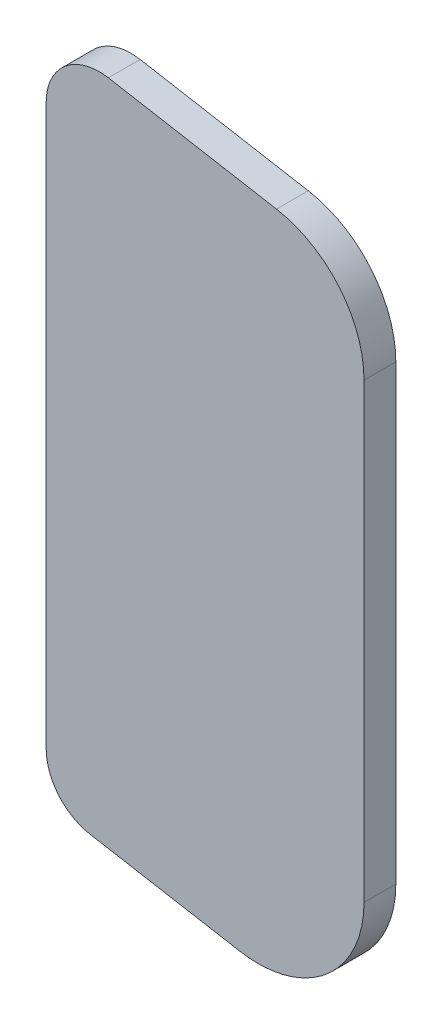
ISO-10303-21;
HEADER;
FILE_DESCRIPTION(('STEP AP214'),'2;1');
FILE_NAME('part.step','',(''),(''),'','','');
FILE_SCHEMA(('AUTOMOTIVE_DESIGN { 1 0 10303 214 1 1 1 1 }'));
ENDSEC;
DATA;
#1=APPLICATION_CONTEXT('core data for automotive mechanical design processes');
#2=APPLICATION_PROTOCOL_DEFINITION('international standard','automotive_design',2000,#1);
#3=PRODUCT_CONTEXT('',#1,'mechanical');
#4=PRODUCT('Part','Part','',(#3));
#5=PRODUCT_RELATED_PRODUCT_CATEGORY('part','',(#4));
#6=PRODUCT_DEFINITION_FORMATION('','',#4);
#7=PRODUCT_DEFINITION_CONTEXT('part definition',#1,'design');
#8=PRODUCT_DEFINITION('design','',#6,#7);
#9=PRODUCT_DEFINITION_SHAPE('','',#8);
#10=(LENGTH_UNIT() NAMED_UNIT(*) SI_UNIT(.MILLI.,.METRE.));
#11=(NAMED_UNIT(*) PLANE_ANGLE_UNIT() SI_UNIT($,.RADIAN.));
#12=(NAMED_UNIT(*) SI_UNIT($,.STERADIAN.) SOLID_ANGLE_UNIT());
#13=UNCERTAINTY_MEASURE_WITH_UNIT(LENGTH_MEASURE(1.E-05),#10,'distance_accuracy_value','');
#14=(GEOMETRIC_REPRESENTATION_CONTEXT(3) GLOBAL_UNCERTAINTY_ASSIGNED_CONTEXT((#13)) GLOBAL_UNIT_ASSIGNED_CONTEXT((#10,
#11,#12)) REPRESENTATION_CONTEXT('',''));
#15=CARTESIAN_POINT('',(0.,0.,0.));
#16=DIRECTION('',(0.,0.,1.));
#17=DIRECTION('',(1.,0.,0.));
#18=AXIS2_PLACEMENT_3D('',#15,#16,#17);
#19=CARTESIAN_POINT('',(-11.6499195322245,12.3461907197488,3.));
#20=DIRECTION('',(0.,0.,-1.));
#21=DIRECTION('',(-1.,0.,0.));
#22=AXIS2_PLACEMENT_3D('',#19,#20,#21);
#23=CYLINDRICAL_SURFACE('',#22,5.);
#24=CARTESIAN_POINT('',(-11.6499195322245,12.3461907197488,0.));
#25=DIRECTION('',(0.,0.,1.));
#26=DIRECTION('',(-1.,0.,0.));
#27=AXIS2_PLACEMENT_3D('',#24,#25,#26);
#28=CIRCLE('',#27,5.);
#29=CARTESIAN_POINT('',(-10.7816786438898,17.2702294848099,0.));
#30=VERTEX_POINT('',#29);
#31=CARTESIAN_POINT('',(-16.6499195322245,12.3461907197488,0.));
#32=VERTEX_POINT('',#31);
#33=EDGE_CURVE('E98',#30,#32,#28,.T.);
#34=ORIENTED_EDGE('',*,*,#33,.T.);
#35=DIRECTION('',(0.,0.,-1.));
#36=VECTOR('',#35,1.);
#37=CARTESIAN_POINT('',(-16.6499195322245,12.3461907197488,3.));
#38=LINE('',#37,#36);
#39=CARTESIAN_POINT('',(-16.6499195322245,12.3461907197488,3.));
#40=VERTEX_POINT('',#39);
#41=EDGE_CURVE('E11',#40,#32,#38,.T.);
#42=ORIENTED_EDGE('',*,*,#41,.F.);
#43=CARTESIAN_POINT('',(-11.6499195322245,12.3461907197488,3.));
#44=DIRECTION('',(0.,0.,1.));
#45=DIRECTION('',(-1.,0.,0.));
#46=AXIS2_PLACEMENT_3D('',#43,#44,#45);
#47=CIRCLE('',#46,5.);
#48=CARTESIAN_POINT('',(-10.7816786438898,17.2702294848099,3.));
#49=VERTEX_POINT('',#48);
#50=EDGE_CURVE('E125',#49,#40,#47,.T.);
#51=ORIENTED_EDGE('',*,*,#50,.F.);
#52=DIRECTION('',(0.,0.,-1.));
#53=VECTOR('',#52,1.);
#54=CARTESIAN_POINT('',(-10.7816786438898,17.2702294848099,3.));
#55=LINE('',#54,#53);
#56=EDGE_CURVE('E111',#49,#30,#55,.T.);
#57=ORIENTED_EDGE('',*,*,#56,.T.);
#58=EDGE_LOOP('',(#34,#42,#51,#57));
#59=FACE_BOUND('',#58,.T.);
#60=ADVANCED_FACE('F30',(#59),#23,.T.);
#61=CARTESIAN_POINT('',(-16.6499195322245,-40.4995431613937,3.));
#62=DIRECTION('',(1.,0.,0.));
#63=DIRECTION('',(0.,1.,0.));
#64=AXIS2_PLACEMENT_3D('',#61,#62,#63);
#65=PLANE('',#64);
#66=DIRECTION('',(0.,-1.,0.));
#67=VECTOR('',#66,1.);
#68=CARTESIAN_POINT('',(-16.6499195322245,-40.4995431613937,0.));
#69=LINE('',#68,#67);
#70=CARTESIAN_POINT('',(-16.6499195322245,-40.4995431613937,0.));
#71=VERTEX_POINT('',#70);
#72=EDGE_CURVE('E94',#32,#71,#69,.T.);
#73=ORIENTED_EDGE('',*,*,#72,.T.);
#74=DIRECTION('',(0.,0.,-1.));
#75=VECTOR('',#74,1.);
#76=CARTESIAN_POINT('',(-16.6499195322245,-40.4995431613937,3.));
#77=LINE('',#76,#75);
#78=CARTESIAN_POINT('',(-16.6499195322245,-40.4995431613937,3.));
#79=VERTEX_POINT('',#78);
#80=EDGE_CURVE('E37',#79,#71,#77,.T.);
#81=ORIENTED_EDGE('',*,*,#80,.F.);
#82=DIRECTION('',(0.,-1.,0.));
#83=VECTOR('',#82,1.);
#84=CARTESIAN_POINT('',(-16.6499195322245,-40.4995431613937,3.));
#85=LINE('',#84,#83);
#86=EDGE_CURVE('E107',#40,#79,#85,.T.);
#87=ORIENTED_EDGE('',*,*,#86,.F.);
#88=ORIENTED_EDGE('',*,*,#41,.T.);
#89=EDGE_LOOP('',(#73,#81,#87,#88));
#90=FACE_BOUND('',#89,.T.);
#91=ADVANCED_FACE('F106',(#90),#65,.F.);
#92=CARTESIAN_POINT('',(-11.6499195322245,-40.4995431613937,3.));
#93=DIRECTION('',(0.,0.,-1.));
#94=DIRECTION('',(-1.,0.,0.));
#95=AXIS2_PLACEMENT_3D('',#92,#93,#94);
#96=CYLINDRICAL_SURFACE('',#95,5.00000000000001);
#97=CARTESIAN_POINT('',(-11.6499195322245,-40.4995431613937,0.));
#98=DIRECTION('',(0.,0.,1.));
#99=DIRECTION('',(-1.,0.,0.));
#100=AXIS2_PLACEMENT_3D('',#97,#98,#99);
#101=CIRCLE('',#100,5.00000000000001);
#102=CARTESIAN_POINT('',(-12.5181604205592,-45.4235819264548,0.));
#103=VERTEX_POINT('',#102);
#104=EDGE_CURVE('E100',#71,#103,#101,.T.);
#105=ORIENTED_EDGE('',*,*,#104,.T.);
#106=DIRECTION('',(0.,0.,-1.));
#107=VECTOR('',#106,1.);
#108=CARTESIAN_POINT('',(-12.5181604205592,-45.4235819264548,3.));
#109=LINE('',#108,#107);
#110=CARTESIAN_POINT('',(-12.5181604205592,-45.4235819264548,3.));
#111=VERTEX_POINT('',#110);
#112=EDGE_CURVE('E151',#111,#103,#109,.T.);
#113=ORIENTED_EDGE('',*,*,#112,.F.);
#114=CARTESIAN_POINT('',(-11.6499195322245,-40.4995431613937,3.));
#115=DIRECTION('',(0.,0.,1.));
#116=DIRECTION('',(-1.,0.,0.));
#117=AXIS2_PLACEMENT_3D('',#114,#115,#116);
#118=CIRCLE('',#117,5.00000000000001);
#119=EDGE_CURVE('E128',#79,#111,#118,.T.);
#120=ORIENTED_EDGE('',*,*,#119,.F.);
#121=ORIENTED_EDGE('',*,*,#80,.T.);
#122=EDGE_LOOP('',(#105,#113,#120,#121));
#123=FACE_BOUND('',#122,.T.);
#124=ADVANCED_FACE('F155',(#123),#96,.T.);
#125=CARTESIAN_POINT('',(1.61359869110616,-47.9153923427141,3.));
#126=DIRECTION('',(0.173648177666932,0.984807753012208,0.));
#127=DIRECTION('',(-0.984807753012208,0.173648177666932,0.));
#128=AXIS2_PLACEMENT_3D('',#125,#126,#127);
#129=PLANE('',#128);
#130=DIRECTION('',(0.984807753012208,-0.173648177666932,0.));
#131=VECTOR('',#130,1.);
#132=CARTESIAN_POINT('',(1.61359869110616,-47.9153923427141,0.));
#133=LINE('',#132,#131);
#134=CARTESIAN_POINT('',(1.61359869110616,-47.9153923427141,0.));
#135=VERTEX_POINT('',#134);
#136=EDGE_CURVE('E115',#103,#135,#133,.T.);
#137=ORIENTED_EDGE('',*,*,#136,.T.);
#138=DIRECTION('',(0.,0.,-1.));
#139=VECTOR('',#138,1.);
#140=CARTESIAN_POINT('',(1.61359869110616,-47.9153923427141,3.));
#141=LINE('',#140,#139);
#142=CARTESIAN_POINT('',(1.61359869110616,-47.9153923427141,3.));
#143=VERTEX_POINT('',#142);
#144=EDGE_CURVE('E148',#143,#135,#141,.T.);
#145=ORIENTED_EDGE('',*,*,#144,.F.);
#146=DIRECTION('',(0.984807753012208,-0.173648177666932,0.));
#147=VECTOR('',#146,1.);
#148=CARTESIAN_POINT('',(1.61359869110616,-47.9153923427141,3.));
#149=LINE('',#148,#147);
#150=EDGE_CURVE('E130',#111,#143,#149,.T.);
#151=ORIENTED_EDGE('',*,*,#150,.F.);
#152=ORIENTED_EDGE('',*,*,#112,.T.);
#153=EDGE_LOOP('',(#137,#145,#151,#152));
#154=FACE_BOUND('',#153,.T.);
#155=ADVANCED_FACE('F163',(#154),#129,.F.);
#156=CARTESIAN_POINT('',(3.35008046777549,-38.067314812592,3.));
#157=DIRECTION('',(0.,0.,-1.));
#158=DIRECTION('',(-1.,0.,0.));
#159=AXIS2_PLACEMENT_3D('',#156,#157,#158);
#160=CYLINDRICAL_SURFACE('',#159,10.);
#161=CARTESIAN_POINT('',(3.35008046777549,-38.067314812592,0.));
#162=DIRECTION('',(0.,0.,1.));
#163=DIRECTION('',(1.,0.,0.));
#164=AXIS2_PLACEMENT_3D('',#161,#162,#163);
#165=CIRCLE('',#164,10.);
#166=CARTESIAN_POINT('',(13.3500804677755,-38.067314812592,0.));
#167=VERTEX_POINT('',#166);
#168=EDGE_CURVE('E117',#135,#167,#165,.T.);
#169=ORIENTED_EDGE('',*,*,#168,.T.);
#170=DIRECTION('',(0.,0.,-1.));
#171=VECTOR('',#170,1.);
#172=CARTESIAN_POINT('',(13.3500804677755,-38.067314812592,3.));
#173=LINE('',#172,#171);
#174=CARTESIAN_POINT('',(13.3500804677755,-38.067314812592,3.));
#175=VERTEX_POINT('',#174);
#176=EDGE_CURVE('E145',#175,#167,#173,.T.);
#177=ORIENTED_EDGE('',*,*,#176,.F.);
#178=CARTESIAN_POINT('',(3.35008046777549,-38.067314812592,3.));
#179=DIRECTION('',(0.,0.,1.));
#180=DIRECTION('',(1.,0.,0.));
#181=AXIS2_PLACEMENT_3D('',#178,#179,#180);
#182=CIRCLE('',#181,10.);
#183=EDGE_CURVE('E132',#143,#175,#182,.T.);
#184=ORIENTED_EDGE('',*,*,#183,.F.);
#185=ORIENTED_EDGE('',*,*,#144,.T.);
#186=EDGE_LOOP('',(#169,#177,#184,#185));
#187=FACE_BOUND('',#186,.T.);
#188=ADVANCED_FACE('F166',(#187),#160,.T.);
#189=CARTESIAN_POINT('',(13.3500804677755,4.62415294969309,3.));
#190=DIRECTION('',(-1.,0.,0.));
#191=DIRECTION('',(0.,0.,1.));
#192=AXIS2_PLACEMENT_3D('',#189,#190,#191);
#193=PLANE('',#192);
#194=DIRECTION('',(0.,1.,0.));
#195=VECTOR('',#194,1.);
#196=CARTESIAN_POINT('',(13.3500804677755,4.62415294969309,0.));
#197=LINE('',#196,#195);
#198=CARTESIAN_POINT('',(13.3500804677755,4.62415294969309,0.));
#199=VERTEX_POINT('',#198);
#200=EDGE_CURVE('E119',#167,#199,#197,.T.);
#201=ORIENTED_EDGE('',*,*,#200,.T.);
#202=DIRECTION('',(0.,0.,-1.));
#203=VECTOR('',#202,1.);
#204=CARTESIAN_POINT('',(13.3500804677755,4.62415294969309,3.));
#205=LINE('',#204,#203);
#206=CARTESIAN_POINT('',(13.3500804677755,4.62415294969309,3.));
#207=VERTEX_POINT('',#206);
#208=EDGE_CURVE('E142',#207,#199,#205,.T.);
#209=ORIENTED_EDGE('',*,*,#208,.F.);
#210=DIRECTION('',(0.,1.,0.));
#211=VECTOR('',#210,1.);
#212=CARTESIAN_POINT('',(13.3500804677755,4.62415294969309,3.));
#213=LINE('',#212,#211);
#214=EDGE_CURVE('E134',#175,#207,#213,.T.);
#215=ORIENTED_EDGE('',*,*,#214,.F.);
#216=ORIENTED_EDGE('',*,*,#176,.T.);
#217=EDGE_LOOP('',(#201,#209,#215,#216));
#218=FACE_BOUND('',#217,.T.);
#219=ADVANCED_FACE('F171',(#218),#193,.F.);
#220=CARTESIAN_POINT('',(3.35008046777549,4.62415294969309,3.));
#221=DIRECTION('',(0.,0.,-1.));
#222=DIRECTION('',(-1.,0.,0.));
#223=AXIS2_PLACEMENT_3D('',#220,#221,#222);
#224=CYLINDRICAL_SURFACE('',#223,10.);
#225=CARTESIAN_POINT('',(3.35008046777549,4.62415294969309,0.));
#226=DIRECTION('',(0.,0.,1.));
#227=DIRECTION('',(-1.,0.,0.));
#228=AXIS2_PLACEMENT_3D('',#225,#226,#227);
#229=CIRCLE('',#228,10.);
#230=CARTESIAN_POINT('',(5.08656224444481,14.4722304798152,0.));
#231=VERTEX_POINT('',#230);
#232=EDGE_CURVE('E121',#199,#231,#229,.T.);
#233=ORIENTED_EDGE('',*,*,#232,.T.);
#234=DIRECTION('',(0.,0.,-1.));
#235=VECTOR('',#234,1.);
#236=CARTESIAN_POINT('',(5.08656224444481,14.4722304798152,3.));
#237=LINE('',#236,#235);
#238=CARTESIAN_POINT('',(5.08656224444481,14.4722304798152,3.));
#239=VERTEX_POINT('',#238);
#240=EDGE_CURVE('E139',#239,#231,#237,.T.);
#241=ORIENTED_EDGE('',*,*,#240,.F.);
#242=CARTESIAN_POINT('',(3.35008046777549,4.62415294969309,3.));
#243=DIRECTION('',(0.,0.,1.));
#244=DIRECTION('',(-1.,0.,0.));
#245=AXIS2_PLACEMENT_3D('',#242,#243,#244);
#246=CIRCLE('',#245,10.);
#247=EDGE_CURVE('E49',#207,#239,#246,.T.);
#248=ORIENTED_EDGE('',*,*,#247,.F.);
#249=ORIENTED_EDGE('',*,*,#208,.T.);
#250=EDGE_LOOP('',(#233,#241,#248,#249));
#251=FACE_BOUND('',#250,.T.);
#252=ADVANCED_FACE('F174',(#251),#224,.T.);
#253=CARTESIAN_POINT('',(-10.7816786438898,17.2702294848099,3.));
#254=DIRECTION('',(-0.173648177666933,-0.984807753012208,0.));
#255=DIRECTION('',(0.984807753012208,-0.173648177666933,0.));
#256=AXIS2_PLACEMENT_3D('',#253,#254,#255);
#257=PLANE('',#256);
#258=DIRECTION('',(-0.984807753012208,0.173648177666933,0.));
#259=VECTOR('',#258,1.);
#260=CARTESIAN_POINT('',(-10.7816786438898,17.2702294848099,0.));
#261=LINE('',#260,#259);
#262=EDGE_CURVE('E123',#231,#30,#261,.T.);
#263=ORIENTED_EDGE('',*,*,#262,.T.);
#264=ORIENTED_EDGE('',*,*,#56,.F.);
#265=DIRECTION('',(-0.984807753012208,0.173648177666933,0.));
#266=VECTOR('',#265,1.);
#267=CARTESIAN_POINT('',(-10.7816786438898,17.2702294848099,3.));
#268=LINE('',#267,#266);
#269=EDGE_CURVE('E44',#239,#49,#268,.T.);
#270=ORIENTED_EDGE('',*,*,#269,.F.);
#271=ORIENTED_EDGE('',*,*,#240,.T.);
#272=EDGE_LOOP('',(#263,#264,#270,#271));
#273=FACE_BOUND('',#272,.T.);
#274=ADVANCED_FACE('F176',(#273),#257,.F.);
#275=CARTESIAN_POINT('',(-11.6499195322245,12.3461907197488,3.));
#276=DIRECTION('',(0.,0.,-1.));
#277=DIRECTION('',(-1.,0.,0.));
#278=AXIS2_PLACEMENT_3D('',#275,#276,#277);
#279=PLANE('',#278);
#280=ORIENTED_EDGE('',*,*,#50,.T.);
#281=ORIENTED_EDGE('',*,*,#86,.T.);
#282=ORIENTED_EDGE('',*,*,#119,.T.);
#283=ORIENTED_EDGE('',*,*,#150,.T.);
#284=ORIENTED_EDGE('',*,*,#183,.T.);
#285=ORIENTED_EDGE('',*,*,#214,.T.);
#286=ORIENTED_EDGE('',*,*,#247,.T.);
#287=ORIENTED_EDGE('',*,*,#269,.T.);
#288=EDGE_LOOP('',(#280,#281,#282,#283,#284,#285,#286,#287));
#289=FACE_BOUND('',#288,.T.);
#290=ADVANCED_FACE('F158',(#289),#279,.F.);
#291=CARTESIAN_POINT('',(-11.6499195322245,12.3461907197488,0.));
#292=DIRECTION('',(0.,0.,-1.));
#293=DIRECTION('',(-1.,0.,0.));
#294=AXIS2_PLACEMENT_3D('',#291,#292,#293);
#295=PLANE('',#294);
#296=ORIENTED_EDGE('',*,*,#33,.F.);
#297=ORIENTED_EDGE('',*,*,#262,.F.);
#298=ORIENTED_EDGE('',*,*,#232,.F.);
#299=ORIENTED_EDGE('',*,*,#200,.F.);
#300=ORIENTED_EDGE('',*,*,#168,.F.);
#301=ORIENTED_EDGE('',*,*,#136,.F.);
#302=ORIENTED_EDGE('',*,*,#104,.F.);
#303=ORIENTED_EDGE('',*,*,#72,.F.);
#304=EDGE_LOOP('',(#296,#297,#298,#299,#300,#301,#302,#303));
#305=FACE_BOUND('',#304,.T.);
#306=ADVANCED_FACE('F95',(#305),#295,.T.);
#307=CLOSED_SHELL('',(#60,#91,#124,#155,#188,#219,#252,#274,#290,#306));
#308=MANIFOLD_SOLID_BREP('B2',#307);
#309=ADVANCED_BREP_SHAPE_REPRESENTATION('',(#18,#308),#14);
#310=SHAPE_DEFINITION_REPRESENTATION(#9,#309);
ENDSEC;
END-ISO-10303-21;
